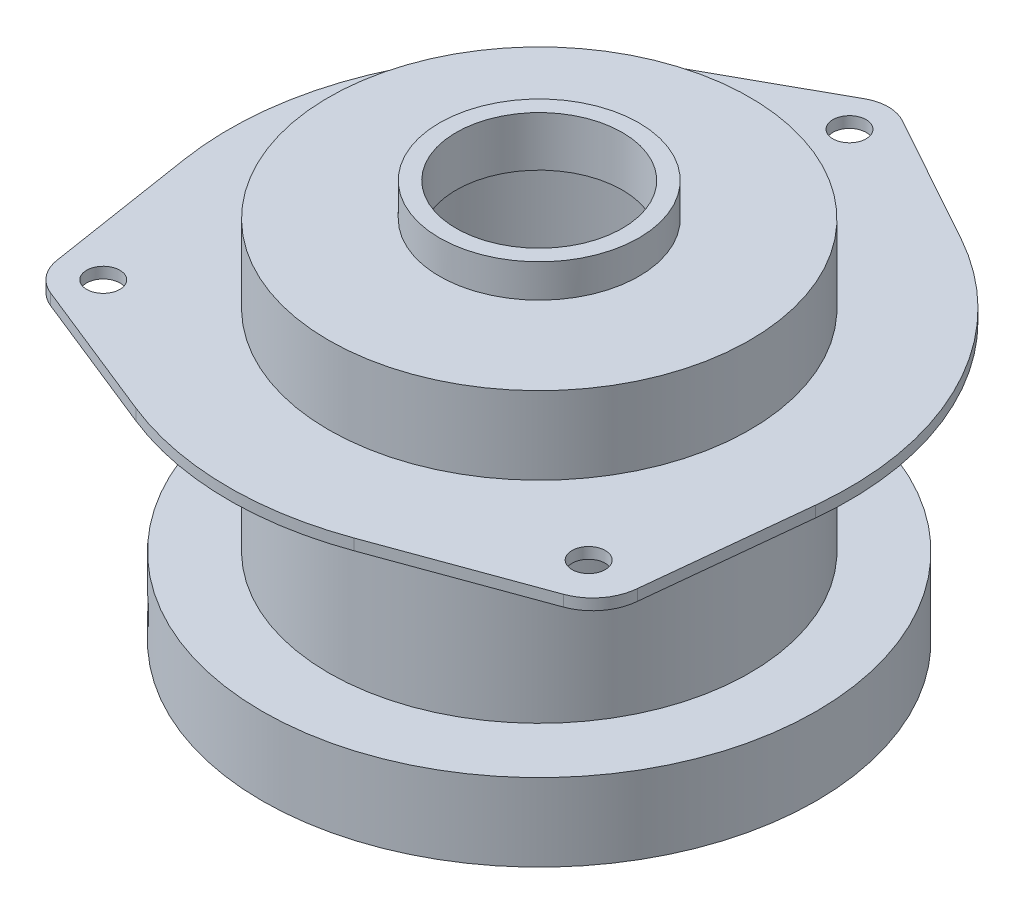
ISO-10303-21;
HEADER;
FILE_DESCRIPTION(('STEP AP214'),'2;1');
FILE_NAME('part.step','',(''),(''),'','','');
FILE_SCHEMA(('AUTOMOTIVE_DESIGN { 1 0 10303 214 1 1 1 1 }'));
ENDSEC;
DATA;
#1=APPLICATION_CONTEXT('core data for automotive mechanical design processes');
#2=APPLICATION_PROTOCOL_DEFINITION('international standard','automotive_design',2000,#1);
#3=PRODUCT_CONTEXT('',#1,'mechanical');
#4=PRODUCT('Part','Part','',(#3));
#5=PRODUCT_RELATED_PRODUCT_CATEGORY('part','',(#4));
#6=PRODUCT_DEFINITION_FORMATION('','',#4);
#7=PRODUCT_DEFINITION_CONTEXT('part definition',#1,'design');
#8=PRODUCT_DEFINITION('design','',#6,#7);
#9=PRODUCT_DEFINITION_SHAPE('','',#8);
#10=(LENGTH_UNIT() NAMED_UNIT(*) SI_UNIT(.MILLI.,.METRE.));
#11=(NAMED_UNIT(*) PLANE_ANGLE_UNIT() SI_UNIT($,.RADIAN.));
#12=(NAMED_UNIT(*) SI_UNIT($,.STERADIAN.) SOLID_ANGLE_UNIT());
#13=UNCERTAINTY_MEASURE_WITH_UNIT(LENGTH_MEASURE(1.E-05),#10,'distance_accuracy_value','');
#14=(GEOMETRIC_REPRESENTATION_CONTEXT(3) GLOBAL_UNCERTAINTY_ASSIGNED_CONTEXT((#13)) GLOBAL_UNIT_ASSIGNED_CONTEXT((#10,
#11,#12)) REPRESENTATION_CONTEXT('',''));
#15=CARTESIAN_POINT('',(0.,0.,0.));
#16=DIRECTION('',(0.,0.,1.));
#17=DIRECTION('',(1.,0.,0.));
#18=AXIS2_PLACEMENT_3D('',#15,#16,#17);
#19=CARTESIAN_POINT('',(0.,-26.,0.));
#20=DIRECTION('',(0.,1.,0.));
#21=DIRECTION('',(0.,0.,1.));
#22=AXIS2_PLACEMENT_3D('',#19,#20,#21);
#23=CYLINDRICAL_SURFACE('',#22,19.);
#24=CARTESIAN_POINT('',(0.,0.,0.));
#25=DIRECTION('',(0.,-1.,0.));
#26=DIRECTION('',(0.,0.,-1.));
#27=AXIS2_PLACEMENT_3D('',#24,#25,#26);
#28=CIRCLE('',#27,19.);
#29=CARTESIAN_POINT('',(0.,0.,19.));
#30=VERTEX_POINT('',#29);
#31=EDGE_CURVE('E301',#30,#30,#28,.T.);
#32=CARTESIAN_POINT('',(0.,-7.,0.));
#33=DIRECTION('',(0.,-1.,0.));
#34=DIRECTION('',(0.,0.,-1.));
#35=AXIS2_PLACEMENT_3D('',#32,#33,#34);
#36=CIRCLE('',#35,19.);
#37=CARTESIAN_POINT('',(0.,-7.,19.));
#38=VERTEX_POINT('',#37);
#39=EDGE_CURVE('E313',#38,#38,#36,.T.);
#40=CARTESIAN_POINT('',(0.,0.,19.));
#41=CARTESIAN_POINT('',(0.,-0.0729166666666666,19.));
#42=CARTESIAN_POINT('',(0.,-0.145833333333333,19.));
#43=CARTESIAN_POINT('',(0.,-0.291666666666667,19.));
#44=CARTESIAN_POINT('',(0.,-0.364583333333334,19.));
#45=CARTESIAN_POINT('',(0.,-0.510416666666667,19.));
#46=CARTESIAN_POINT('',(0.,-0.583333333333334,19.));
#47=CARTESIAN_POINT('',(0.,-0.729166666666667,19.));
#48=CARTESIAN_POINT('',(0.,-0.802083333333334,19.));
#49=CARTESIAN_POINT('',(0.,-0.947916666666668,19.));
#50=CARTESIAN_POINT('',(0.,-1.02083333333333,19.));
#51=CARTESIAN_POINT('',(0.,-1.16666666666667,19.));
#52=CARTESIAN_POINT('',(0.,-1.23958333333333,19.));
#53=CARTESIAN_POINT('',(0.,-1.38541666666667,19.));
#54=CARTESIAN_POINT('',(0.,-1.45833333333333,19.));
#55=CARTESIAN_POINT('',(0.,-1.60416666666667,19.));
#56=CARTESIAN_POINT('',(0.,-1.67708333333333,19.));
#57=CARTESIAN_POINT('',(0.,-1.82291666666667,19.));
#58=CARTESIAN_POINT('',(0.,-1.89583333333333,19.));
#59=CARTESIAN_POINT('',(0.,-2.04166666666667,19.));
#60=CARTESIAN_POINT('',(0.,-2.11458333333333,19.));
#61=CARTESIAN_POINT('',(0.,-2.26041666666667,19.));
#62=CARTESIAN_POINT('',(0.,-2.33333333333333,19.));
#63=CARTESIAN_POINT('',(0.,-2.47916666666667,19.));
#64=CARTESIAN_POINT('',(0.,-2.55208333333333,19.));
#65=CARTESIAN_POINT('',(0.,-2.69791666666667,19.));
#66=CARTESIAN_POINT('',(0.,-2.77083333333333,19.));
#67=CARTESIAN_POINT('',(0.,-2.91666666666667,19.));
#68=CARTESIAN_POINT('',(0.,-2.98958333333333,19.));
#69=CARTESIAN_POINT('',(0.,-3.13541666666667,19.));
#70=CARTESIAN_POINT('',(0.,-3.20833333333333,19.));
#71=CARTESIAN_POINT('',(0.,-3.35416666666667,19.));
#72=CARTESIAN_POINT('',(0.,-3.42708333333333,19.));
#73=CARTESIAN_POINT('',(0.,-3.57291666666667,19.));
#74=CARTESIAN_POINT('',(0.,-3.64583333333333,19.));
#75=CARTESIAN_POINT('',(0.,-3.79166666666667,19.));
#76=CARTESIAN_POINT('',(0.,-3.86458333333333,19.));
#77=CARTESIAN_POINT('',(0.,-4.01041666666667,19.));
#78=CARTESIAN_POINT('',(0.,-4.08333333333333,19.));
#79=CARTESIAN_POINT('',(0.,-4.22916666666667,19.));
#80=CARTESIAN_POINT('',(0.,-4.30208333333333,19.));
#81=CARTESIAN_POINT('',(0.,-4.44791666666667,19.));
#82=CARTESIAN_POINT('',(0.,-4.52083333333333,19.));
#83=CARTESIAN_POINT('',(0.,-4.66666666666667,19.));
#84=CARTESIAN_POINT('',(0.,-4.73958333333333,19.));
#85=CARTESIAN_POINT('',(0.,-4.88541666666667,19.));
#86=CARTESIAN_POINT('',(0.,-4.95833333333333,19.));
#87=CARTESIAN_POINT('',(0.,-5.10416666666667,19.));
#88=CARTESIAN_POINT('',(0.,-5.17708333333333,19.));
#89=CARTESIAN_POINT('',(0.,-5.32291666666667,19.));
#90=CARTESIAN_POINT('',(0.,-5.39583333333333,19.));
#91=CARTESIAN_POINT('',(0.,-5.54166666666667,19.));
#92=CARTESIAN_POINT('',(0.,-5.61458333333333,19.));
#93=CARTESIAN_POINT('',(0.,-5.76041666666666,19.));
#94=CARTESIAN_POINT('',(0.,-5.83333333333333,19.));
#95=CARTESIAN_POINT('',(0.,-5.97916666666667,19.));
#96=CARTESIAN_POINT('',(0.,-6.05208333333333,19.));
#97=CARTESIAN_POINT('',(0.,-6.19791666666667,19.));
#98=CARTESIAN_POINT('',(0.,-6.27083333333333,19.));
#99=CARTESIAN_POINT('',(0.,-6.41666666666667,19.));
#100=CARTESIAN_POINT('',(0.,-6.48958333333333,19.));
#101=CARTESIAN_POINT('',(0.,-6.63541666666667,19.));
#102=CARTESIAN_POINT('',(0.,-6.70833333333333,19.));
#103=CARTESIAN_POINT('',(0.,-6.85416666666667,19.));
#104=CARTESIAN_POINT('',(0.,-6.92708333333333,19.));
#105=CARTESIAN_POINT('',(0.,-7.,19.));
#106=B_SPLINE_CURVE_WITH_KNOTS('',3,(#40,#41,#42,#43,#44,#45,#46,#47,#48,#49,#50,#51,#52,#53,
#54,#55,#56,#57,#58,#59,#60,#61,#62,#63,#64,#65,#66,#67,#68,#69,#70,#71,#72,#73,#74,#75,#76,#77,
#78,#79,#80,#81,#82,#83,#84,#85,#86,#87,#88,#89,#90,#91,#92,#93,#94,#95,#96,#97,#98,#99,#100,
#101,#102,#103,#104,#105),.UNSPECIFIED.,.F.,.F.,(4,2,2,2,2,2,2,2,2,2,2,2,2,2,2,2,2,2,2,2,2,2,2,
2,2,2,2,2,2,2,2,2,4),(0.,0.21875,0.4375,0.656250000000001,0.875000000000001,1.09375,1.3125,
1.53125,1.75,1.96875,2.1875,2.40625,2.625,2.84375,3.0625,3.28125,3.5,3.71875,3.9375,4.15625,
4.375,4.59375,4.8125,5.03125,5.25,5.46875,5.6875,5.90625,6.125,6.34375,6.5625,6.78125,7.),.UNSPECIFIED.);
#107=EDGE_CURVE('BSEAM27',#30,#38,#106,.T.);
#108=ORIENTED_EDGE('',*,*,#31,.T.);
#109=ORIENTED_EDGE('',*,*,#39,.F.);
#110=ORIENTED_EDGE('',*,*,#107,.T.);
#111=ORIENTED_EDGE('',*,*,#107,.F.);
#112=EDGE_LOOP('',(#108,#110,#109,#111));
#113=FACE_BOUND('',#112,.T.);
#114=ADVANCED_FACE('F27',(#113),#23,.T.);
#115=CARTESIAN_POINT('',(0.,3.,0.));
#116=DIRECTION('',(0.,-1.,0.));
#117=DIRECTION('',(0.,0.,-1.));
#118=AXIS2_PLACEMENT_3D('',#115,#116,#117);
#119=CYLINDRICAL_SURFACE('',#118,9.);
#120=CARTESIAN_POINT('',(0.,3.,0.));
#121=DIRECTION('',(0.,1.,0.));
#122=DIRECTION('',(0.,0.,1.));
#123=AXIS2_PLACEMENT_3D('',#120,#121,#122);
#124=CIRCLE('',#123,9.);
#125=CARTESIAN_POINT('',(0.,3.,9.));
#126=VERTEX_POINT('',#125);
#127=EDGE_CURVE('E310',#126,#126,#124,.T.);
#128=ORIENTED_EDGE('',*,*,#127,.F.);
#129=EDGE_LOOP('',(#128));
#130=FACE_BOUND('',#129,.T.);
#131=CARTESIAN_POINT('',(0.,0.,0.));
#132=DIRECTION('',(0.,-1.,0.));
#133=DIRECTION('',(0.,0.,-1.));
#134=AXIS2_PLACEMENT_3D('',#131,#132,#133);
#135=CIRCLE('',#134,9.);
#136=CARTESIAN_POINT('',(0.,0.,-9.));
#137=VERTEX_POINT('',#136);
#138=EDGE_CURVE('E307',#137,#137,#135,.T.);
#139=ORIENTED_EDGE('',*,*,#138,.F.);
#140=EDGE_LOOP('',(#139));
#141=FACE_BOUND('',#140,.T.);
#142=ADVANCED_FACE('F29',(#130,#141),#119,.T.);
#143=CARTESIAN_POINT('',(0.,3.,0.));
#144=DIRECTION('',(0.,1.,0.));
#145=DIRECTION('',(0.,0.,1.));
#146=AXIS2_PLACEMENT_3D('',#143,#144,#145);
#147=PLANE('',#146);
#148=CARTESIAN_POINT('',(0.,3.,0.));
#149=DIRECTION('',(0.,-1.,0.));
#150=DIRECTION('',(0.,0.,-1.));
#151=AXIS2_PLACEMENT_3D('',#148,#149,#150);
#152=CIRCLE('',#151,7.5);
#153=CARTESIAN_POINT('',(0.,3.,-7.5));
#154=VERTEX_POINT('',#153);
#155=EDGE_CURVE('E256',#154,#154,#152,.T.);
#156=ORIENTED_EDGE('',*,*,#155,.T.);
#157=EDGE_LOOP('',(#156));
#158=FACE_BOUND('',#157,.T.);
#159=ORIENTED_EDGE('',*,*,#127,.T.);
#160=EDGE_LOOP('',(#159));
#161=FACE_BOUND('',#160,.T.);
#162=ADVANCED_FACE('F351',(#158,#161),#147,.T.);
#163=CARTESIAN_POINT('',(0.,0.,0.));
#164=DIRECTION('',(0.,-1.,0.));
#165=DIRECTION('',(0.,0.,-1.));
#166=AXIS2_PLACEMENT_3D('',#163,#164,#165);
#167=PLANE('',#166);
#168=ORIENTED_EDGE('',*,*,#31,.F.);
#169=EDGE_LOOP('',(#168));
#170=FACE_BOUND('',#169,.T.);
#171=ORIENTED_EDGE('',*,*,#138,.T.);
#172=EDGE_LOOP('',(#171));
#173=FACE_BOUND('',#172,.T.);
#174=ADVANCED_FACE('F356',(#170,#173),#167,.F.);
#175=CARTESIAN_POINT('',(0.,-8.,0.));
#176=DIRECTION('',(0.,1.,0.));
#177=DIRECTION('',(0.,0.,1.));
#178=AXIS2_PLACEMENT_3D('',#175,#176,#177);
#179=CIRCLE('',#178,19.);
#180=CARTESIAN_POINT('',(0.,-8.,19.));
#181=VERTEX_POINT('',#180);
#182=EDGE_CURVE('E156',#181,#181,#179,.T.);
#183=CARTESIAN_POINT('',(0.,-26.,0.));
#184=DIRECTION('',(0.,-1.,0.));
#185=DIRECTION('',(0.,0.,-1.));
#186=AXIS2_PLACEMENT_3D('',#183,#184,#185);
#187=CIRCLE('',#186,19.);
#188=CARTESIAN_POINT('',(0.,-26.,19.));
#189=VERTEX_POINT('',#188);
#190=EDGE_CURVE('E304',#189,#189,#187,.T.);
#191=CARTESIAN_POINT('',(0.,-8.,19.));
#192=CARTESIAN_POINT('',(0.,-8.1875,19.));
#193=CARTESIAN_POINT('',(0.,-8.375,19.));
#194=CARTESIAN_POINT('',(0.,-8.75,19.));
#195=CARTESIAN_POINT('',(0.,-8.9375,19.));
#196=CARTESIAN_POINT('',(0.,-9.3125,19.));
#197=CARTESIAN_POINT('',(0.,-9.5,19.));
#198=CARTESIAN_POINT('',(0.,-9.875,19.));
#199=CARTESIAN_POINT('',(0.,-10.0625,19.));
#200=CARTESIAN_POINT('',(0.,-10.4375,19.));
#201=CARTESIAN_POINT('',(0.,-10.625,19.));
#202=CARTESIAN_POINT('',(0.,-11.,19.));
#203=CARTESIAN_POINT('',(0.,-11.1875,19.));
#204=CARTESIAN_POINT('',(0.,-11.5625,19.));
#205=CARTESIAN_POINT('',(0.,-11.75,19.));
#206=CARTESIAN_POINT('',(0.,-12.125,19.));
#207=CARTESIAN_POINT('',(0.,-12.3125,19.));
#208=CARTESIAN_POINT('',(0.,-12.6875,19.));
#209=CARTESIAN_POINT('',(0.,-12.875,19.));
#210=CARTESIAN_POINT('',(0.,-13.25,19.));
#211=CARTESIAN_POINT('',(0.,-13.4375,19.));
#212=CARTESIAN_POINT('',(0.,-13.8125,19.));
#213=CARTESIAN_POINT('',(0.,-14.,19.));
#214=CARTESIAN_POINT('',(0.,-14.375,19.));
#215=CARTESIAN_POINT('',(0.,-14.5625,19.));
#216=CARTESIAN_POINT('',(0.,-14.9375,19.));
#217=CARTESIAN_POINT('',(0.,-15.125,19.));
#218=CARTESIAN_POINT('',(0.,-15.5,19.));
#219=CARTESIAN_POINT('',(0.,-15.6875,19.));
#220=CARTESIAN_POINT('',(0.,-16.0625,19.));
#221=CARTESIAN_POINT('',(0.,-16.25,19.));
#222=CARTESIAN_POINT('',(0.,-16.625,19.));
#223=CARTESIAN_POINT('',(0.,-16.8125,19.));
#224=CARTESIAN_POINT('',(0.,-17.1875,19.));
#225=CARTESIAN_POINT('',(0.,-17.375,19.));
#226=CARTESIAN_POINT('',(0.,-17.75,19.));
#227=CARTESIAN_POINT('',(0.,-17.9375,19.));
#228=CARTESIAN_POINT('',(0.,-18.3125,19.));
#229=CARTESIAN_POINT('',(0.,-18.5,19.));
#230=CARTESIAN_POINT('',(0.,-18.875,19.));
#231=CARTESIAN_POINT('',(0.,-19.0625,19.));
#232=CARTESIAN_POINT('',(0.,-19.4375,19.));
#233=CARTESIAN_POINT('',(0.,-19.625,19.));
#234=CARTESIAN_POINT('',(0.,-20.,19.));
#235=CARTESIAN_POINT('',(0.,-20.1875,19.));
#236=CARTESIAN_POINT('',(0.,-20.5625,19.));
#237=CARTESIAN_POINT('',(0.,-20.75,19.));
#238=CARTESIAN_POINT('',(0.,-21.125,19.));
#239=CARTESIAN_POINT('',(0.,-21.3125,19.));
#240=CARTESIAN_POINT('',(0.,-21.6875,19.));
#241=CARTESIAN_POINT('',(0.,-21.875,19.));
#242=CARTESIAN_POINT('',(0.,-22.25,19.));
#243=CARTESIAN_POINT('',(0.,-22.4375,19.));
#244=CARTESIAN_POINT('',(0.,-22.8125,19.));
#245=CARTESIAN_POINT('',(0.,-23.,19.));
#246=CARTESIAN_POINT('',(0.,-23.375,19.));
#247=CARTESIAN_POINT('',(0.,-23.5625,19.));
#248=CARTESIAN_POINT('',(0.,-23.9375,19.));
#249=CARTESIAN_POINT('',(0.,-24.125,19.));
#250=CARTESIAN_POINT('',(0.,-24.5,19.));
#251=CARTESIAN_POINT('',(0.,-24.6875,19.));
#252=CARTESIAN_POINT('',(0.,-25.0625,19.));
#253=CARTESIAN_POINT('',(0.,-25.25,19.));
#254=CARTESIAN_POINT('',(0.,-25.625,19.));
#255=CARTESIAN_POINT('',(0.,-25.8125,19.));
#256=CARTESIAN_POINT('',(0.,-26.,19.));
#257=B_SPLINE_CURVE_WITH_KNOTS('',3,(#191,#192,#193,#194,#195,#196,#197,#198,#199,#200,#201,
#202,#203,#204,#205,#206,#207,#208,#209,#210,#211,#212,#213,#214,#215,#216,#217,#218,#219,#220,
#221,#222,#223,#224,#225,#226,#227,#228,#229,#230,#231,#232,#233,#234,#235,#236,#237,#238,#239,
#240,#241,#242,#243,#244,#245,#246,#247,#248,#249,#250,#251,#252,#253,#254,#255,#256),
.UNSPECIFIED.,.F.,.F.,(4,2,2,2,2,2,2,2,2,2,2,2,2,2,2,2,2,2,2,2,2,2,2,2,2,2,2,2,2,2,2,2,4),(0.,
0.5625,1.125,1.6875,2.25,2.8125,3.375,3.9375,4.5,5.0625,5.625,6.1875,6.75,7.3125,7.875,8.4375,
9.,9.5625,10.125,10.6875,11.25,11.8125,12.375,12.9375,13.5,14.0625,14.625,15.1875,15.75,16.3125,
16.875,17.4375,18.),.UNSPECIFIED.);
#258=EDGE_CURVE('BSEAM345',#181,#189,#257,.T.);
#259=ORIENTED_EDGE('',*,*,#182,.F.);
#260=ORIENTED_EDGE('',*,*,#190,.F.);
#261=ORIENTED_EDGE('',*,*,#258,.T.);
#262=ORIENTED_EDGE('',*,*,#258,.F.);
#263=EDGE_LOOP('',(#259,#261,#260,#262));
#264=FACE_BOUND('',#263,.T.);
#265=ADVANCED_FACE('F345',(#264),#23,.T.);
#266=CARTESIAN_POINT('',(0.,-26.,0.));
#267=DIRECTION('',(0.,-1.,0.));
#268=DIRECTION('',(0.,0.,-1.));
#269=AXIS2_PLACEMENT_3D('',#266,#267,#268);
#270=PLANE('',#269);
#271=CARTESIAN_POINT('',(0.,-26.,0.));
#272=DIRECTION('',(0.,-1.,0.));
#273=DIRECTION('',(0.,0.,-1.));
#274=AXIS2_PLACEMENT_3D('',#271,#272,#273);
#275=CIRCLE('',#274,25.);
#276=CARTESIAN_POINT('',(0.,-26.,-25.));
#277=VERTEX_POINT('',#276);
#278=EDGE_CURVE('E284',#277,#277,#275,.T.);
#279=ORIENTED_EDGE('',*,*,#278,.F.);
#280=EDGE_LOOP('',(#279));
#281=FACE_BOUND('',#280,.T.);
#282=ORIENTED_EDGE('',*,*,#190,.T.);
#283=EDGE_LOOP('',(#282));
#284=FACE_BOUND('',#283,.T.);
#285=ADVANCED_FACE('F355',(#281,#284),#270,.F.);
#286=CARTESIAN_POINT('',(0.,-33.,0.));
#287=DIRECTION('',(0.,1.,0.));
#288=DIRECTION('',(0.,0.,1.));
#289=AXIS2_PLACEMENT_3D('',#286,#287,#288);
#290=CYLINDRICAL_SURFACE('',#289,25.);
#291=CARTESIAN_POINT('',(0.,-29.1165253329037,0.));
#292=DIRECTION('',(0.,1.,0.));
#293=DIRECTION('',(0.,0.,1.));
#294=AXIS2_PLACEMENT_3D('',#291,#292,#293);
#295=CIRCLE('',#294,25.);
#296=CARTESIAN_POINT('',(-16.2480768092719,-29.1165253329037,-19.));
#297=VERTEX_POINT('',#296);
#298=CARTESIAN_POINT('',(-16.2480768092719,-29.1165253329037,19.));
#299=VERTEX_POINT('',#298);
#300=EDGE_CURVE('E155',#297,#299,#295,.T.);
#301=ORIENTED_EDGE('',*,*,#300,.T.);
#302=DIRECTION('',(0.,1.,0.));
#303=VECTOR('',#302,1.);
#304=CARTESIAN_POINT('',(-16.2480768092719,-33.,19.));
#305=LINE('',#304,#303);
#306=CARTESIAN_POINT('',(-16.2480768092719,-30.9628283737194,19.));
#307=VERTEX_POINT('',#306);
#308=EDGE_CURVE('E147',#299,#307,#305,.F.);
#309=ORIENTED_EDGE('',*,*,#308,.T.);
#310=CARTESIAN_POINT('',(0.,-30.9628283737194,0.));
#311=DIRECTION('',(0.,-1.,0.));
#312=DIRECTION('',(0.,0.,-1.));
#313=AXIS2_PLACEMENT_3D('',#310,#311,#312);
#314=CIRCLE('',#313,25.);
#315=CARTESIAN_POINT('',(-16.2480768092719,-30.9628283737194,-19.));
#316=VERTEX_POINT('',#315);
#317=EDGE_CURVE('E136',#307,#316,#314,.T.);
#318=ORIENTED_EDGE('',*,*,#317,.T.);
#319=DIRECTION('',(0.,1.,0.));
#320=VECTOR('',#319,1.);
#321=CARTESIAN_POINT('',(-16.2480768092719,-33.,-19.));
#322=LINE('',#321,#320);
#323=EDGE_CURVE('E141',#316,#297,#322,.T.);
#324=ORIENTED_EDGE('',*,*,#323,.T.);
#325=EDGE_LOOP('',(#301,#309,#318,#324));
#326=FACE_BOUND('',#325,.T.);
#327=CARTESIAN_POINT('',(0.,-33.,0.));
#328=DIRECTION('',(0.,-1.,0.));
#329=DIRECTION('',(0.,0.,-1.));
#330=AXIS2_PLACEMENT_3D('',#327,#328,#329);
#331=CIRCLE('',#330,25.);
#332=CARTESIAN_POINT('',(0.,-33.,-25.));
#333=VERTEX_POINT('',#332);
#334=EDGE_CURVE('E298',#333,#333,#331,.T.);
#335=ORIENTED_EDGE('',*,*,#334,.F.);
#336=EDGE_LOOP('',(#335));
#337=FACE_BOUND('',#336,.T.);
#338=ORIENTED_EDGE('',*,*,#278,.T.);
#339=EDGE_LOOP('',(#338));
#340=FACE_BOUND('',#339,.T.);
#341=ADVANCED_FACE('F153',(#326,#337,#340),#290,.T.);
#342=CARTESIAN_POINT('',(0.,-33.,0.));
#343=DIRECTION('',(0.,-1.,0.));
#344=DIRECTION('',(0.,0.,-1.));
#345=AXIS2_PLACEMENT_3D('',#342,#343,#344);
#346=PLANE('',#345);
#347=CARTESIAN_POINT('',(0.,-33.,0.));
#348=DIRECTION('',(0.,-1.,0.));
#349=DIRECTION('',(0.,0.,-1.));
#350=AXIS2_PLACEMENT_3D('',#347,#348,#349);
#351=CIRCLE('',#350,23.5);
#352=CARTESIAN_POINT('',(0.,-33.,-23.5));
#353=VERTEX_POINT('',#352);
#354=EDGE_CURVE('E289',#353,#353,#351,.T.);
#355=ORIENTED_EDGE('',*,*,#354,.F.);
#356=EDGE_LOOP('',(#355));
#357=FACE_BOUND('',#356,.T.);
#358=ORIENTED_EDGE('',*,*,#334,.T.);
#359=EDGE_LOOP('',(#358));
#360=FACE_BOUND('',#359,.T.);
#361=ADVANCED_FACE('F470',(#357,#360),#346,.T.);
#362=CARTESIAN_POINT('',(0.,3.,0.));
#363=DIRECTION('',(0.,-1.,0.));
#364=DIRECTION('',(0.,0.,-1.));
#365=AXIS2_PLACEMENT_3D('',#362,#363,#364);
#366=CYLINDRICAL_SURFACE('',#365,7.5);
#367=CARTESIAN_POINT('',(0.,-1.5,0.));
#368=DIRECTION('',(0.,-1.,0.));
#369=DIRECTION('',(0.,0.,-1.));
#370=AXIS2_PLACEMENT_3D('',#367,#368,#369);
#371=CIRCLE('',#370,7.5);
#372=CARTESIAN_POINT('',(0.,-1.5,-7.5));
#373=VERTEX_POINT('',#372);
#374=EDGE_CURVE('E281',#373,#373,#371,.T.);
#375=ORIENTED_EDGE('',*,*,#374,.T.);
#376=EDGE_LOOP('',(#375));
#377=FACE_BOUND('',#376,.T.);
#378=ORIENTED_EDGE('',*,*,#155,.F.);
#379=EDGE_LOOP('',(#378));
#380=FACE_BOUND('',#379,.T.);
#381=ADVANCED_FACE('F467',(#377,#380),#366,.F.);
#382=CARTESIAN_POINT('',(0.,-1.5,0.));
#383=DIRECTION('',(0.,-1.,0.));
#384=DIRECTION('',(0.,0.,-1.));
#385=AXIS2_PLACEMENT_3D('',#382,#383,#384);
#386=PLANE('',#385);
#387=CARTESIAN_POINT('',(0.,-1.5,0.));
#388=DIRECTION('',(0.,-1.,0.));
#389=DIRECTION('',(0.,0.,-1.));
#390=AXIS2_PLACEMENT_3D('',#387,#388,#389);
#391=CIRCLE('',#390,17.5);
#392=CARTESIAN_POINT('',(0.,-1.5,17.5));
#393=VERTEX_POINT('',#392);
#394=EDGE_CURVE('E286',#393,#393,#391,.T.);
#395=ORIENTED_EDGE('',*,*,#394,.T.);
#396=EDGE_LOOP('',(#395));
#397=FACE_BOUND('',#396,.T.);
#398=ORIENTED_EDGE('',*,*,#374,.F.);
#399=EDGE_LOOP('',(#398));
#400=FACE_BOUND('',#399,.T.);
#401=ADVANCED_FACE('F469',(#397,#400),#386,.T.);
#402=CARTESIAN_POINT('',(0.,-26.,0.));
#403=DIRECTION('',(0.,1.,0.));
#404=DIRECTION('',(0.,0.,1.));
#405=AXIS2_PLACEMENT_3D('',#402,#403,#404);
#406=CYLINDRICAL_SURFACE('',#405,17.5);
#407=CARTESIAN_POINT('',(0.,-27.5,0.));
#408=DIRECTION('',(0.,-1.,0.));
#409=DIRECTION('',(0.,0.,-1.));
#410=AXIS2_PLACEMENT_3D('',#407,#408,#409);
#411=CIRCLE('',#410,17.5);
#412=CARTESIAN_POINT('',(0.,-27.5,17.5));
#413=VERTEX_POINT('',#412);
#414=EDGE_CURVE('E285',#413,#413,#411,.T.);
#415=CARTESIAN_POINT('',(0.,-27.5,17.5));
#416=CARTESIAN_POINT('',(0.,-27.2291666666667,17.5));
#417=CARTESIAN_POINT('',(0.,-26.9583333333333,17.5));
#418=CARTESIAN_POINT('',(0.,-26.4166666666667,17.5));
#419=CARTESIAN_POINT('',(0.,-26.1458333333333,17.5));
#420=CARTESIAN_POINT('',(0.,-25.6041666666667,17.5));
#421=CARTESIAN_POINT('',(0.,-25.3333333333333,17.5));
#422=CARTESIAN_POINT('',(0.,-24.7916666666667,17.5));
#423=CARTESIAN_POINT('',(0.,-24.5208333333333,17.5));
#424=CARTESIAN_POINT('',(0.,-23.9791666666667,17.5));
#425=CARTESIAN_POINT('',(0.,-23.7083333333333,17.5));
#426=CARTESIAN_POINT('',(0.,-23.1666666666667,17.5));
#427=CARTESIAN_POINT('',(0.,-22.8958333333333,17.5));
#428=CARTESIAN_POINT('',(0.,-22.3541666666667,17.5));
#429=CARTESIAN_POINT('',(0.,-22.0833333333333,17.5));
#430=CARTESIAN_POINT('',(0.,-21.5416666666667,17.5));
#431=CARTESIAN_POINT('',(0.,-21.2708333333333,17.5));
#432=CARTESIAN_POINT('',(0.,-20.7291666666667,17.5));
#433=CARTESIAN_POINT('',(0.,-20.4583333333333,17.5));
#434=CARTESIAN_POINT('',(0.,-19.9166666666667,17.5));
#435=CARTESIAN_POINT('',(0.,-19.6458333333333,17.5));
#436=CARTESIAN_POINT('',(0.,-19.1041666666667,17.5));
#437=CARTESIAN_POINT('',(0.,-18.8333333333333,17.5));
#438=CARTESIAN_POINT('',(0.,-18.2916666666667,17.5));
#439=CARTESIAN_POINT('',(0.,-18.0208333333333,17.5));
#440=CARTESIAN_POINT('',(0.,-17.4791666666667,17.5));
#441=CARTESIAN_POINT('',(0.,-17.2083333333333,17.5));
#442=CARTESIAN_POINT('',(0.,-16.6666666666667,17.5));
#443=CARTESIAN_POINT('',(0.,-16.3958333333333,17.5));
#444=CARTESIAN_POINT('',(0.,-15.8541666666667,17.5));
#445=CARTESIAN_POINT('',(0.,-15.5833333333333,17.5));
#446=CARTESIAN_POINT('',(0.,-15.0416666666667,17.5));
#447=CARTESIAN_POINT('',(0.,-14.7708333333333,17.5));
#448=CARTESIAN_POINT('',(0.,-14.2291666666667,17.5));
#449=CARTESIAN_POINT('',(0.,-13.9583333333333,17.5));
#450=CARTESIAN_POINT('',(0.,-13.4166666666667,17.5));
#451=CARTESIAN_POINT('',(0.,-13.1458333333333,17.5));
#452=CARTESIAN_POINT('',(0.,-12.6041666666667,17.5));
#453=CARTESIAN_POINT('',(0.,-12.3333333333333,17.5));
#454=CARTESIAN_POINT('',(0.,-11.7916666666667,17.5));
#455=CARTESIAN_POINT('',(0.,-11.5208333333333,17.5));
#456=CARTESIAN_POINT('',(0.,-10.9791666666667,17.5));
#457=CARTESIAN_POINT('',(0.,-10.7083333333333,17.5));
#458=CARTESIAN_POINT('',(0.,-10.1666666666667,17.5));
#459=CARTESIAN_POINT('',(0.,-9.89583333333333,17.5));
#460=CARTESIAN_POINT('',(0.,-9.35416666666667,17.5));
#461=CARTESIAN_POINT('',(0.,-9.08333333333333,17.5));
#462=CARTESIAN_POINT('',(0.,-8.54166666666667,17.5));
#463=CARTESIAN_POINT('',(0.,-8.27083333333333,17.5));
#464=CARTESIAN_POINT('',(0.,-7.72916666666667,17.5));
#465=CARTESIAN_POINT('',(0.,-7.45833333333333,17.5));
#466=CARTESIAN_POINT('',(0.,-6.91666666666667,17.5));
#467=CARTESIAN_POINT('',(0.,-6.64583333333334,17.5));
#468=CARTESIAN_POINT('',(0.,-6.10416666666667,17.5));
#469=CARTESIAN_POINT('',(0.,-5.83333333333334,17.5));
#470=CARTESIAN_POINT('',(0.,-5.29166666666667,17.5));
#471=CARTESIAN_POINT('',(0.,-5.02083333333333,17.5));
#472=CARTESIAN_POINT('',(0.,-4.47916666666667,17.5));
#473=CARTESIAN_POINT('',(0.,-4.20833333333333,17.5));
#474=CARTESIAN_POINT('',(0.,-3.66666666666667,17.5));
#475=CARTESIAN_POINT('',(0.,-3.39583333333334,17.5));
#476=CARTESIAN_POINT('',(0.,-2.85416666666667,17.5));
#477=CARTESIAN_POINT('',(0.,-2.58333333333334,17.5));
#478=CARTESIAN_POINT('',(0.,-2.04166666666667,17.5));
#479=CARTESIAN_POINT('',(0.,-1.77083333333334,17.5));
#480=CARTESIAN_POINT('',(0.,-1.5,17.5));
#481=B_SPLINE_CURVE_WITH_KNOTS('',3,(#415,#416,#417,#418,#419,#420,#421,#422,#423,#424,#425,
#426,#427,#428,#429,#430,#431,#432,#433,#434,#435,#436,#437,#438,#439,#440,#441,#442,#443,#444,
#445,#446,#447,#448,#449,#450,#451,#452,#453,#454,#455,#456,#457,#458,#459,#460,#461,#462,#463,
#464,#465,#466,#467,#468,#469,#470,#471,#472,#473,#474,#475,#476,#477,#478,#479,#480),
.UNSPECIFIED.,.F.,.F.,(4,2,2,2,2,2,2,2,2,2,2,2,2,2,2,2,2,2,2,2,2,2,2,2,2,2,2,2,2,2,2,2,4),(0.,
0.812500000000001,1.625,2.4375,3.25,4.0625,4.875,5.6875,6.5,7.3125,8.125,8.9375,9.75,10.5625,
11.375,12.1875,13.,13.8125,14.625,15.4375,16.25,17.0625,17.875,18.6875,19.5,20.3125,21.125,
21.9375,22.75,23.5625,24.375,25.1875,26.),.UNSPECIFIED.);
#482=EDGE_CURVE('BSEAM474',#413,#393,#481,.T.);
#483=ORIENTED_EDGE('',*,*,#414,.T.);
#484=ORIENTED_EDGE('',*,*,#394,.F.);
#485=ORIENTED_EDGE('',*,*,#482,.T.);
#486=ORIENTED_EDGE('',*,*,#482,.F.);
#487=EDGE_LOOP('',(#483,#485,#484,#486));
#488=FACE_BOUND('',#487,.T.);
#489=ADVANCED_FACE('F474',(#488),#406,.F.);
#490=CARTESIAN_POINT('',(0.,-27.5,0.));
#491=DIRECTION('',(0.,-1.,0.));
#492=DIRECTION('',(0.,0.,-1.));
#493=AXIS2_PLACEMENT_3D('',#490,#491,#492);
#494=PLANE('',#493);
#495=CARTESIAN_POINT('',(0.,-27.5,0.));
#496=DIRECTION('',(0.,-1.,0.));
#497=DIRECTION('',(0.,0.,-1.));
#498=AXIS2_PLACEMENT_3D('',#495,#496,#497);
#499=CIRCLE('',#498,23.5);
#500=CARTESIAN_POINT('',(0.,-27.5,-23.5));
#501=VERTEX_POINT('',#500);
#502=EDGE_CURVE('E280',#501,#501,#499,.T.);
#503=ORIENTED_EDGE('',*,*,#502,.T.);
#504=EDGE_LOOP('',(#503));
#505=FACE_BOUND('',#504,.T.);
#506=ORIENTED_EDGE('',*,*,#414,.F.);
#507=EDGE_LOOP('',(#506));
#508=FACE_BOUND('',#507,.T.);
#509=ADVANCED_FACE('F478',(#505,#508),#494,.T.);
#510=CARTESIAN_POINT('',(0.,-33.,0.));
#511=DIRECTION('',(0.,1.,0.));
#512=DIRECTION('',(0.,0.,1.));
#513=AXIS2_PLACEMENT_3D('',#510,#511,#512);
#514=CYLINDRICAL_SURFACE('',#513,23.5);
#515=DIRECTION('',(0.,1.,0.));
#516=VECTOR('',#515,1.);
#517=CARTESIAN_POINT('',(-13.8293166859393,-33.,19.));
#518=LINE('',#517,#516);
#519=CARTESIAN_POINT('',(-13.8293166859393,-29.1165253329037,19.));
#520=VERTEX_POINT('',#519);
#521=CARTESIAN_POINT('',(-13.8293166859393,-30.9628283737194,19.));
#522=VERTEX_POINT('',#521);
#523=EDGE_CURVE('E11',#520,#522,#518,.F.);
#524=ORIENTED_EDGE('',*,*,#523,.F.);
#525=CARTESIAN_POINT('',(0.,-29.1165253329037,0.));
#526=DIRECTION('',(0.,1.,0.));
#527=DIRECTION('',(0.,0.,1.));
#528=AXIS2_PLACEMENT_3D('',#525,#526,#527);
#529=CIRCLE('',#528,23.5);
#530=CARTESIAN_POINT('',(-13.8293166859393,-29.1165253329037,-19.));
#531=VERTEX_POINT('',#530);
#532=EDGE_CURVE('E35',#531,#520,#529,.T.);
#533=ORIENTED_EDGE('',*,*,#532,.F.);
#534=DIRECTION('',(0.,1.,0.));
#535=VECTOR('',#534,1.);
#536=CARTESIAN_POINT('',(-13.8293166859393,-33.,-19.));
#537=LINE('',#536,#535);
#538=CARTESIAN_POINT('',(-13.8293166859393,-30.9628283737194,-19.));
#539=VERTEX_POINT('',#538);
#540=EDGE_CURVE('E318',#539,#531,#537,.T.);
#541=ORIENTED_EDGE('',*,*,#540,.F.);
#542=CARTESIAN_POINT('',(0.,-30.9628283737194,0.));
#543=DIRECTION('',(0.,-1.,0.));
#544=DIRECTION('',(0.,0.,-1.));
#545=AXIS2_PLACEMENT_3D('',#542,#543,#544);
#546=CIRCLE('',#545,23.5);
#547=EDGE_CURVE('E316',#522,#539,#546,.T.);
#548=ORIENTED_EDGE('',*,*,#547,.F.);
#549=EDGE_LOOP('',(#524,#533,#541,#548));
#550=FACE_BOUND('',#549,.T.);
#551=ORIENTED_EDGE('',*,*,#354,.T.);
#552=EDGE_LOOP('',(#551));
#553=FACE_BOUND('',#552,.T.);
#554=ORIENTED_EDGE('',*,*,#502,.F.);
#555=EDGE_LOOP('',(#554));
#556=FACE_BOUND('',#555,.T.);
#557=ADVANCED_FACE('F328',(#550,#553,#556),#514,.F.);
#558=CARTESIAN_POINT('',(-21.9038990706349,-8.,17.4418810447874));
#559=DIRECTION('',(0.,1.,0.));
#560=DIRECTION('',(0.,0.,1.));
#561=AXIS2_PLACEMENT_3D('',#558,#559,#560);
#562=CYLINDRICAL_SURFACE('',#561,3.65966615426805);
#563=CARTESIAN_POINT('',(-21.9038990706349,-7.,17.4418810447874));
#564=DIRECTION('',(0.,1.,0.));
#565=DIRECTION('',(0.,0.,-1.));
#566=AXIS2_PLACEMENT_3D('',#563,#564,#565);
#567=CIRCLE('',#566,3.65966615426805);
#568=CARTESIAN_POINT('',(-25.5194383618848,-7.,18.0084778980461));
#569=VERTEX_POINT('',#568);
#570=CARTESIAN_POINT('',(-23.265775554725,-7.,20.8387102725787));
#571=VERTEX_POINT('',#570);
#572=EDGE_CURVE('E181',#569,#571,#567,.T.);
#573=ORIENTED_EDGE('',*,*,#572,.F.);
#574=DIRECTION('',(0.,1.,0.));
#575=VECTOR('',#574,1.);
#576=CARTESIAN_POINT('',(-25.5194383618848,-8.,18.0084778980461));
#577=LINE('',#576,#575);
#578=CARTESIAN_POINT('',(-25.5194383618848,-8.,18.0084778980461));
#579=VERTEX_POINT('',#578);
#580=EDGE_CURVE('E254',#579,#569,#577,.T.);
#581=ORIENTED_EDGE('',*,*,#580,.F.);
#582=CARTESIAN_POINT('',(-21.9038990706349,-8.,17.4418810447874));
#583=DIRECTION('',(0.,1.,0.));
#584=DIRECTION('',(0.,0.,-1.));
#585=AXIS2_PLACEMENT_3D('',#582,#583,#584);
#586=CIRCLE('',#585,3.65966615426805);
#587=CARTESIAN_POINT('',(-23.265775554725,-8.,20.8387102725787));
#588=VERTEX_POINT('',#587);
#589=EDGE_CURVE('E217',#579,#588,#586,.T.);
#590=ORIENTED_EDGE('',*,*,#589,.T.);
#591=DIRECTION('',(0.,1.,0.));
#592=VECTOR('',#591,1.);
#593=CARTESIAN_POINT('',(-23.265775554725,-8.,20.8387102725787));
#594=LINE('',#593,#592);
#595=EDGE_CURVE('E253',#588,#571,#594,.T.);
#596=ORIENTED_EDGE('',*,*,#595,.T.);
#597=EDGE_LOOP('',(#573,#581,#590,#596));
#598=FACE_BOUND('',#597,.T.);
#599=ADVANCED_FACE('F429',(#598),#562,.T.);
#600=CARTESIAN_POINT('',(-25.5194383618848,-8.,18.0084778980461));
#601=DIRECTION('',(-0.987942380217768,0.,0.154822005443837));
#602=DIRECTION('',(0.154822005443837,0.,0.987942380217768));
#603=AXIS2_PLACEMENT_3D('',#600,#601,#602);
#604=PLANE('',#603);
#605=DIRECTION('',(0.154822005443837,0.,0.987942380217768));
#606=VECTOR('',#605,1.);
#607=CARTESIAN_POINT('',(-25.5194383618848,-7.,18.0084778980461));
#608=LINE('',#607,#606);
#609=CARTESIAN_POINT('',(-27.6477182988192,-7.,4.42760520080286));
#610=VERTEX_POINT('',#609);
#611=EDGE_CURVE('E214',#610,#569,#608,.T.);
#612=ORIENTED_EDGE('',*,*,#611,.F.);
#613=DIRECTION('',(0.,1.,0.));
#614=VECTOR('',#613,1.);
#615=CARTESIAN_POINT('',(-27.6477182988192,-8.,4.42760520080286));
#616=LINE('',#615,#614);
#617=CARTESIAN_POINT('',(-27.6477182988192,-8.,4.42760520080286));
#618=VERTEX_POINT('',#617);
#619=EDGE_CURVE('E257',#618,#610,#616,.T.);
#620=ORIENTED_EDGE('',*,*,#619,.F.);
#621=DIRECTION('',(0.154822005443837,0.,0.987942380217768));
#622=VECTOR('',#621,1.);
#623=CARTESIAN_POINT('',(-25.5194383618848,-8.,18.0084778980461));
#624=LINE('',#623,#622);
#625=EDGE_CURVE('E250',#618,#579,#624,.T.);
#626=ORIENTED_EDGE('',*,*,#625,.T.);
#627=ORIENTED_EDGE('',*,*,#580,.T.);
#628=EDGE_LOOP('',(#612,#620,#626,#627));
#629=FACE_BOUND('',#628,.T.);
#630=ADVANCED_FACE('F391',(#629),#604,.T.);
#631=CARTESIAN_POINT('',(-1.2471891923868E-07,-8.,-9.93126522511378E-08));
#632=DIRECTION('',(0.,1.,0.));
#633=DIRECTION('',(0.,0.,1.));
#634=AXIS2_PLACEMENT_3D('',#631,#632,#633);
#635=CYLINDRICAL_SURFACE('',#634,28.0000001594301);
#636=CARTESIAN_POINT('',(-1.2471891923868E-07,-7.,-9.93126522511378E-08));
#637=DIRECTION('',(0.,1.,0.));
#638=DIRECTION('',(0.,0.,1.));
#639=AXIS2_PLACEMENT_3D('',#636,#637,#638);
#640=CIRCLE('',#639,28.0000001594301);
#641=CARTESIAN_POINT('',(-13.5554419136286,-7.,-24.500000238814));
#642=VERTEX_POINT('',#641);
#643=EDGE_CURVE('E211',#642,#610,#640,.T.);
#644=ORIENTED_EDGE('',*,*,#643,.F.);
#645=DIRECTION('',(0.,1.,0.));
#646=VECTOR('',#645,1.);
#647=CARTESIAN_POINT('',(-13.5554419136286,-8.,-24.500000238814));
#648=LINE('',#647,#646);
#649=CARTESIAN_POINT('',(-13.5554419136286,-8.,-24.500000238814));
#650=VERTEX_POINT('',#649);
#651=EDGE_CURVE('E259',#650,#642,#648,.T.);
#652=ORIENTED_EDGE('',*,*,#651,.F.);
#653=CARTESIAN_POINT('',(-1.2471891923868E-07,-8.,-9.93126522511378E-08));
#654=DIRECTION('',(0.,1.,0.));
#655=DIRECTION('',(0.,0.,1.));
#656=AXIS2_PLACEMENT_3D('',#653,#654,#655);
#657=CIRCLE('',#656,28.0000001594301);
#658=EDGE_CURVE('E247',#650,#618,#657,.T.);
#659=ORIENTED_EDGE('',*,*,#658,.T.);
#660=ORIENTED_EDGE('',*,*,#619,.T.);
#661=EDGE_LOOP('',(#644,#652,#659,#660));
#662=FACE_BOUND('',#661,.T.);
#663=ADVANCED_FACE('F395',(#662),#635,.T.);
#664=CARTESIAN_POINT('',(-1.69443033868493,-8.,-31.0625002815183));
#665=DIRECTION('',(-0.484122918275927,0.,-0.875));
#666=DIRECTION('',(-0.875,0.,0.484122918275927));
#667=AXIS2_PLACEMENT_3D('',#664,#665,#666);
#668=PLANE('',#667);
#669=DIRECTION('',(-0.875,0.,0.484122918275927));
#670=VECTOR('',#669,1.);
#671=CARTESIAN_POINT('',(-1.69443033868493,-7.,-31.0625002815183));
#672=LINE('',#671,#670);
#673=CARTESIAN_POINT('',(-1.69443033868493,-7.,-31.0625002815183));
#674=VERTEX_POINT('',#673);
#675=EDGE_CURVE('E208',#674,#642,#672,.T.);
#676=ORIENTED_EDGE('',*,*,#675,.F.);
#677=DIRECTION('',(0.,1.,0.));
#678=VECTOR('',#677,1.);
#679=CARTESIAN_POINT('',(-1.69443033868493,-8.,-31.0625002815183));
#680=LINE('',#679,#678);
#681=CARTESIAN_POINT('',(-1.69443033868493,-8.,-31.0625002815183));
#682=VERTEX_POINT('',#681);
#683=EDGE_CURVE('E261',#682,#674,#680,.T.);
#684=ORIENTED_EDGE('',*,*,#683,.F.);
#685=DIRECTION('',(-0.875,0.,0.484122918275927));
#686=VECTOR('',#685,1.);
#687=CARTESIAN_POINT('',(-1.69443033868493,-8.,-31.0625002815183));
#688=LINE('',#687,#686);
#689=EDGE_CURVE('E244',#682,#650,#688,.T.);
#690=ORIENTED_EDGE('',*,*,#689,.T.);
#691=ORIENTED_EDGE('',*,*,#651,.T.);
#692=EDGE_LOOP('',(#676,#684,#690,#691));
#693=FACE_BOUND('',#692,.T.);
#694=ADVANCED_FACE('F400',(#693),#668,.T.);
#695=CARTESIAN_POINT('',(-1.24719154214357E-07,-8.,-28.0000002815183));
#696=DIRECTION('',(0.,1.,0.));
#697=DIRECTION('',(0.,0.,1.));
#698=AXIS2_PLACEMENT_3D('',#695,#696,#697);
#699=CYLINDRICAL_SURFACE('',#698,3.50000000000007);
#700=CARTESIAN_POINT('',(-1.24719154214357E-07,-7.,-28.0000002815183));
#701=DIRECTION('',(0.,1.,0.));
#702=DIRECTION('',(0.,0.,1.));
#703=AXIS2_PLACEMENT_3D('',#700,#701,#702);
#704=CIRCLE('',#703,3.50000000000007);
#705=CARTESIAN_POINT('',(1.69443008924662,-7.,-31.0625002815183));
#706=VERTEX_POINT('',#705);
#707=EDGE_CURVE('E205',#706,#674,#704,.T.);
#708=ORIENTED_EDGE('',*,*,#707,.F.);
#709=DIRECTION('',(0.,1.,0.));
#710=VECTOR('',#709,1.);
#711=CARTESIAN_POINT('',(1.69443008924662,-8.,-31.0625002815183));
#712=LINE('',#711,#710);
#713=CARTESIAN_POINT('',(1.69443008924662,-8.,-31.0625002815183));
#714=VERTEX_POINT('',#713);
#715=EDGE_CURVE('E263',#714,#706,#712,.T.);
#716=ORIENTED_EDGE('',*,*,#715,.F.);
#717=CARTESIAN_POINT('',(-1.24719154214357E-07,-8.,-28.0000002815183));
#718=DIRECTION('',(0.,1.,0.));
#719=DIRECTION('',(0.,0.,1.));
#720=AXIS2_PLACEMENT_3D('',#717,#718,#719);
#721=CIRCLE('',#720,3.50000000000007);
#722=EDGE_CURVE('E241',#714,#682,#721,.T.);
#723=ORIENTED_EDGE('',*,*,#722,.T.);
#724=ORIENTED_EDGE('',*,*,#683,.T.);
#725=EDGE_LOOP('',(#708,#716,#723,#724));
#726=FACE_BOUND('',#725,.T.);
#727=ADVANCED_FACE('F403',(#726),#699,.T.);
#728=CARTESIAN_POINT('',(1.69443008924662,-8.,-31.0625002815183));
#729=DIRECTION('',(0.484122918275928,0.,-0.875));
#730=DIRECTION('',(-0.875,0.,-0.484122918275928));
#731=AXIS2_PLACEMENT_3D('',#728,#729,#730);
#732=PLANE('',#731);
#733=DIRECTION('',(-0.875,0.,-0.484122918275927));
#734=VECTOR('',#733,1.);
#735=CARTESIAN_POINT('',(1.69443008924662,-7.,-31.0625002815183));
#736=LINE('',#735,#734);
#737=CARTESIAN_POINT('',(13.5554416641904,-7.,-24.500000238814));
#738=VERTEX_POINT('',#737);
#739=EDGE_CURVE('E202',#738,#706,#736,.T.);
#740=ORIENTED_EDGE('',*,*,#739,.F.);
#741=DIRECTION('',(0.,1.,0.));
#742=VECTOR('',#741,1.);
#743=CARTESIAN_POINT('',(13.5554416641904,-8.,-24.500000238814));
#744=LINE('',#743,#742);
#745=CARTESIAN_POINT('',(13.5554416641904,-8.,-24.500000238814));
#746=VERTEX_POINT('',#745);
#747=EDGE_CURVE('E265',#746,#738,#744,.T.);
#748=ORIENTED_EDGE('',*,*,#747,.F.);
#749=DIRECTION('',(-0.875,0.,-0.484122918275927));
#750=VECTOR('',#749,1.);
#751=CARTESIAN_POINT('',(1.69443008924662,-8.,-31.0625002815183));
#752=LINE('',#751,#750);
#753=EDGE_CURVE('E238',#746,#714,#752,.T.);
#754=ORIENTED_EDGE('',*,*,#753,.T.);
#755=ORIENTED_EDGE('',*,*,#715,.T.);
#756=EDGE_LOOP('',(#740,#748,#754,#755));
#757=FACE_BOUND('',#756,.T.);
#758=ADVANCED_FACE('F408',(#757),#732,.T.);
#759=CARTESIAN_POINT('',(-1.24719311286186E-07,-8.,-9.93126913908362E-08));
#760=DIRECTION('',(0.,1.,0.));
#761=DIRECTION('',(0.,0.,1.));
#762=AXIS2_PLACEMENT_3D('',#759,#760,#761);
#763=CYLINDRICAL_SURFACE('',#762,28.00000015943);
#764=CARTESIAN_POINT('',(-1.24719311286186E-07,-7.,-9.93126913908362E-08));
#765=DIRECTION('',(0.,1.,0.));
#766=DIRECTION('',(0.,0.,1.));
#767=AXIS2_PLACEMENT_3D('',#764,#765,#766);
#768=CIRCLE('',#767,28.00000015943);
#769=CARTESIAN_POINT('',(27.8488065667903,-7.,2.90585171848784));
#770=VERTEX_POINT('',#769);
#771=EDGE_CURVE('E199',#770,#738,#768,.T.);
#772=ORIENTED_EDGE('',*,*,#771,.F.);
#773=DIRECTION('',(0.,1.,0.));
#774=VECTOR('',#773,1.);
#775=CARTESIAN_POINT('',(27.8488065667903,-8.,2.90585171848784));
#776=LINE('',#775,#774);
#777=CARTESIAN_POINT('',(27.8488065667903,-8.,2.90585171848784));
#778=VERTEX_POINT('',#777);
#779=EDGE_CURVE('E267',#778,#770,#776,.T.);
#780=ORIENTED_EDGE('',*,*,#779,.F.);
#781=CARTESIAN_POINT('',(-1.24719311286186E-07,-8.,-9.93126913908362E-08));
#782=DIRECTION('',(0.,1.,0.));
#783=DIRECTION('',(0.,0.,1.));
#784=AXIS2_PLACEMENT_3D('',#781,#782,#783);
#785=CIRCLE('',#784,28.00000015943);
#786=EDGE_CURVE('E235',#778,#746,#785,.T.);
#787=ORIENTED_EDGE('',*,*,#786,.T.);
#788=ORIENTED_EDGE('',*,*,#747,.T.);
#789=EDGE_LOOP('',(#772,#780,#787,#788));
#790=FACE_BOUND('',#789,.T.);
#791=ADVANCED_FACE('F411',(#790),#763,.T.);
#792=CARTESIAN_POINT('',(26.332061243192,-8.,17.4418810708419));
#793=DIRECTION('',(0.9946002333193,0.,0.103780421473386));
#794=DIRECTION('',(0.103780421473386,0.,-0.9946002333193));
#795=AXIS2_PLACEMENT_3D('',#792,#793,#794);
#796=PLANE('',#795);
#797=DIRECTION('',(0.103780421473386,0.,-0.9946002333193));
#798=VECTOR('',#797,1.);
#799=CARTESIAN_POINT('',(26.332061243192,-7.,17.4418810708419));
#800=LINE('',#799,#798);
#801=CARTESIAN_POINT('',(26.332061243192,-7.,17.4418810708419));
#802=VERTEX_POINT('',#801);
#803=EDGE_CURVE('E196',#802,#770,#800,.T.);
#804=ORIENTED_EDGE('',*,*,#803,.F.);
#805=DIRECTION('',(0.,1.,0.));
#806=VECTOR('',#805,1.);
#807=CARTESIAN_POINT('',(26.332061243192,-8.,17.4418810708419));
#808=LINE('',#807,#806);
#809=CARTESIAN_POINT('',(26.332061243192,-8.,17.4418810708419));
#810=VERTEX_POINT('',#809);
#811=EDGE_CURVE('E269',#810,#802,#808,.T.);
#812=ORIENTED_EDGE('',*,*,#811,.F.);
#813=DIRECTION('',(0.103780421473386,0.,-0.9946002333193));
#814=VECTOR('',#813,1.);
#815=CARTESIAN_POINT('',(26.332061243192,-8.,17.4418810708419));
#816=LINE('',#815,#814);
#817=EDGE_CURVE('E232',#810,#778,#816,.T.);
#818=ORIENTED_EDGE('',*,*,#817,.T.);
#819=ORIENTED_EDGE('',*,*,#779,.T.);
#820=EDGE_LOOP('',(#804,#812,#818,#819));
#821=FACE_BOUND('',#820,.T.);
#822=ADVANCED_FACE('F416',(#821),#796,.T.);
#823=CARTESIAN_POINT('',(21.9174577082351,-8.,17.0956187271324));
#824=DIRECTION('',(0.,1.,0.));
#825=DIRECTION('',(0.,0.,1.));
#826=AXIS2_PLACEMENT_3D('',#823,#824,#825);
#827=CYLINDRICAL_SURFACE('',#826,4.42816237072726);
#828=CARTESIAN_POINT('',(21.9174577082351,-7.,17.0956187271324));
#829=DIRECTION('',(0.,1.,0.));
#830=DIRECTION('',(0.,0.,-1.));
#831=AXIS2_PLACEMENT_3D('',#828,#829,#830);
#832=CIRCLE('',#831,4.42816237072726);
#833=CARTESIAN_POINT('',(23.435083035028,-7.,21.2555989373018));
#834=VERTEX_POINT('',#833);
#835=EDGE_CURVE('E193',#834,#802,#832,.T.);
#836=ORIENTED_EDGE('',*,*,#835,.F.);
#837=DIRECTION('',(0.,1.,0.));
#838=VECTOR('',#837,1.);
#839=CARTESIAN_POINT('',(23.435083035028,-8.,21.2555989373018));
#840=LINE('',#839,#838);
#841=CARTESIAN_POINT('',(23.435083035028,-8.,21.2555989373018));
#842=VERTEX_POINT('',#841);
#843=EDGE_CURVE('E271',#842,#834,#840,.T.);
#844=ORIENTED_EDGE('',*,*,#843,.F.);
#845=CARTESIAN_POINT('',(21.9174577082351,-8.,17.0956187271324));
#846=DIRECTION('',(0.,1.,0.));
#847=DIRECTION('',(0.,0.,-1.));
#848=AXIS2_PLACEMENT_3D('',#845,#846,#847);
#849=CIRCLE('',#848,4.42816237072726);
#850=EDGE_CURVE('E229',#842,#810,#849,.T.);
#851=ORIENTED_EDGE('',*,*,#850,.T.);
#852=ORIENTED_EDGE('',*,*,#811,.T.);
#853=EDGE_LOOP('',(#836,#844,#851,#852));
#854=FACE_BOUND('',#853,.T.);
#855=ADVANCED_FACE('F419',(#854),#827,.T.);
#856=CARTESIAN_POINT('',(23.435083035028,-8.,21.2555989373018));
#857=DIRECTION('',(0.3427212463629,0.,0.939437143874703));
#858=DIRECTION('',(0.939437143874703,0.,-0.3427212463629));
#859=AXIS2_PLACEMENT_3D('',#856,#857,#858);
#860=PLANE('',#859);
#861=DIRECTION('',(0.939437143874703,0.,-0.3427212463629));
#862=VECTOR('',#861,1.);
#863=CARTESIAN_POINT('',(23.435083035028,-7.,21.2555989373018));
#864=LINE('',#863,#862);
#865=CARTESIAN_POINT('',(9.59619482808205,-7.,26.3042400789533));
#866=VERTEX_POINT('',#865);
#867=EDGE_CURVE('E190',#866,#834,#864,.T.);
#868=ORIENTED_EDGE('',*,*,#867,.F.);
#869=DIRECTION('',(0.,1.,0.));
#870=VECTOR('',#869,1.);
#871=CARTESIAN_POINT('',(9.59619482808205,-8.,26.3042400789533));
#872=LINE('',#871,#870);
#873=CARTESIAN_POINT('',(9.59619482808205,-8.,26.3042400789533));
#874=VERTEX_POINT('',#873);
#875=EDGE_CURVE('E273',#874,#866,#872,.T.);
#876=ORIENTED_EDGE('',*,*,#875,.F.);
#877=DIRECTION('',(0.939437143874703,0.,-0.3427212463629));
#878=VECTOR('',#877,1.);
#879=CARTESIAN_POINT('',(23.435083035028,-8.,21.2555989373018));
#880=LINE('',#879,#878);
#881=EDGE_CURVE('E226',#874,#842,#880,.T.);
#882=ORIENTED_EDGE('',*,*,#881,.T.);
#883=ORIENTED_EDGE('',*,*,#843,.T.);
#884=EDGE_LOOP('',(#868,#876,#882,#883));
#885=FACE_BOUND('',#884,.T.);
#886=ADVANCED_FACE('F423',(#885),#860,.T.);
#887=CARTESIAN_POINT('',(-1.24719162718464E-07,-8.,-9.93127399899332E-08));
#888=DIRECTION('',(0.,1.,0.));
#889=DIRECTION('',(0.,0.,1.));
#890=AXIS2_PLACEMENT_3D('',#887,#888,#889);
#891=CYLINDRICAL_SURFACE('',#890,28.0000001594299);
#892=CARTESIAN_POINT('',(-1.24719162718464E-07,-7.,-9.93127399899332E-08));
#893=DIRECTION('',(0.,1.,0.));
#894=DIRECTION('',(0.,0.,-1.));
#895=AXIS2_PLACEMENT_3D('',#892,#893,#894);
#896=CIRCLE('',#895,28.0000001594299);
#897=CARTESIAN_POINT('',(-10.4196778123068,-7.,25.9890423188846));
#898=VERTEX_POINT('',#897);
#899=EDGE_CURVE('E187',#898,#866,#896,.T.);
#900=ORIENTED_EDGE('',*,*,#899,.F.);
#901=DIRECTION('',(0.,1.,0.));
#902=VECTOR('',#901,1.);
#903=CARTESIAN_POINT('',(-10.4196778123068,-8.,25.9890423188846));
#904=LINE('',#903,#902);
#905=CARTESIAN_POINT('',(-10.4196778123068,-8.,25.9890423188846));
#906=VERTEX_POINT('',#905);
#907=EDGE_CURVE('E275',#906,#898,#904,.T.);
#908=ORIENTED_EDGE('',*,*,#907,.F.);
#909=CARTESIAN_POINT('',(-1.24719162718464E-07,-8.,-9.93127399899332E-08));
#910=DIRECTION('',(0.,1.,0.));
#911=DIRECTION('',(0.,0.,-1.));
#912=AXIS2_PLACEMENT_3D('',#909,#910,#911);
#913=CIRCLE('',#912,28.0000001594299);
#914=EDGE_CURVE('E223',#906,#874,#913,.T.);
#915=ORIENTED_EDGE('',*,*,#914,.T.);
#916=ORIENTED_EDGE('',*,*,#875,.T.);
#917=EDGE_LOOP('',(#900,#908,#915,#916));
#918=FACE_BOUND('',#917,.T.);
#919=ADVANCED_FACE('F426',(#918),#891,.T.);
#920=CARTESIAN_POINT('',(-10.4196778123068,-8.,25.9890423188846));
#921=DIRECTION('',(-0.372131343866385,0.,0.928180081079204));
#922=DIRECTION('',(0.928180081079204,0.,0.372131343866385));
#923=AXIS2_PLACEMENT_3D('',#920,#921,#922);
#924=PLANE('',#923);
#925=DIRECTION('',(0.928180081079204,0.,0.372131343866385));
#926=VECTOR('',#925,1.);
#927=CARTESIAN_POINT('',(-10.4196778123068,-7.,25.9890423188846));
#928=LINE('',#927,#926);
#929=EDGE_CURVE('E184',#571,#898,#928,.T.);
#930=ORIENTED_EDGE('',*,*,#929,.F.);
#931=ORIENTED_EDGE('',*,*,#595,.F.);
#932=DIRECTION('',(0.928180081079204,0.,0.372131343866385));
#933=VECTOR('',#932,1.);
#934=CARTESIAN_POINT('',(-10.4196778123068,-8.,25.9890423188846));
#935=LINE('',#934,#933);
#936=EDGE_CURVE('E220',#588,#906,#935,.T.);
#937=ORIENTED_EDGE('',*,*,#936,.T.);
#938=ORIENTED_EDGE('',*,*,#907,.T.);
#939=EDGE_LOOP('',(#930,#931,#937,#938));
#940=FACE_BOUND('',#939,.T.);
#941=ADVANCED_FACE('F375',(#940),#924,.T.);
#942=CARTESIAN_POINT('',(-21.9038990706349,-8.,17.4418810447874));
#943=DIRECTION('',(0.,-1.,0.));
#944=DIRECTION('',(0.,0.,-1.));
#945=AXIS2_PLACEMENT_3D('',#942,#943,#944);
#946=PLANE('',#945);
#947=ORIENTED_EDGE('',*,*,#182,.T.);
#948=EDGE_LOOP('',(#947));
#949=FACE_BOUND('',#948,.T.);
#950=CARTESIAN_POINT('',(-21.9038988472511,-8.,17.4418810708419));
#951=DIRECTION('',(0.,1.,0.));
#952=DIRECTION('',(0.,0.,-1.));
#953=AXIS2_PLACEMENT_3D('',#950,#951,#952);
#954=CIRCLE('',#953,1.5);
#955=CARTESIAN_POINT('',(-21.9038988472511,-8.,15.9418810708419));
#956=VERTEX_POINT('',#955);
#957=EDGE_CURVE('E166',#956,#956,#954,.T.);
#958=ORIENTED_EDGE('',*,*,#957,.T.);
#959=EDGE_LOOP('',(#958));
#960=FACE_BOUND('',#959,.T.);
#961=CARTESIAN_POINT('',(21.9038988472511,-8.,17.4418810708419));
#962=DIRECTION('',(0.,1.,0.));
#963=DIRECTION('',(0.,0.,1.));
#964=AXIS2_PLACEMENT_3D('',#961,#962,#963);
#965=CIRCLE('',#964,1.5);
#966=CARTESIAN_POINT('',(21.9038988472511,-8.,18.9418810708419));
#967=VERTEX_POINT('',#966);
#968=EDGE_CURVE('E172',#967,#967,#965,.T.);
#969=ORIENTED_EDGE('',*,*,#968,.T.);
#970=EDGE_LOOP('',(#969));
#971=FACE_BOUND('',#970,.T.);
#972=CARTESIAN_POINT('',(0.,-8.,-28.));
#973=DIRECTION('',(0.,1.,0.));
#974=DIRECTION('',(0.,0.,1.));
#975=AXIS2_PLACEMENT_3D('',#972,#973,#974);
#976=CIRCLE('',#975,1.5);
#977=CARTESIAN_POINT('',(0.,-8.,-26.5));
#978=VERTEX_POINT('',#977);
#979=EDGE_CURVE('E178',#978,#978,#976,.T.);
#980=ORIENTED_EDGE('',*,*,#979,.T.);
#981=EDGE_LOOP('',(#980));
#982=FACE_BOUND('',#981,.T.);
#983=ORIENTED_EDGE('',*,*,#589,.F.);
#984=ORIENTED_EDGE('',*,*,#625,.F.);
#985=ORIENTED_EDGE('',*,*,#658,.F.);
#986=ORIENTED_EDGE('',*,*,#689,.F.);
#987=ORIENTED_EDGE('',*,*,#722,.F.);
#988=ORIENTED_EDGE('',*,*,#753,.F.);
#989=ORIENTED_EDGE('',*,*,#786,.F.);
#990=ORIENTED_EDGE('',*,*,#817,.F.);
#991=ORIENTED_EDGE('',*,*,#850,.F.);
#992=ORIENTED_EDGE('',*,*,#881,.F.);
#993=ORIENTED_EDGE('',*,*,#914,.F.);
#994=ORIENTED_EDGE('',*,*,#936,.F.);
#995=EDGE_LOOP('',(#983,#984,#985,#986,#987,#988,#989,#990,#991,#992,#993,#994));
#996=FACE_BOUND('',#995,.T.);
#997=ADVANCED_FACE('F371',(#949,#960,#971,#982,#996),#946,.T.);
#998=CARTESIAN_POINT('',(-21.9038990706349,-7.,17.4418810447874));
#999=DIRECTION('',(0.,-1.,0.));
#1000=DIRECTION('',(0.,0.,-1.));
#1001=AXIS2_PLACEMENT_3D('',#998,#999,#1000);
#1002=PLANE('',#1001);
#1003=ORIENTED_EDGE('',*,*,#39,.T.);
#1004=EDGE_LOOP('',(#1003));
#1005=FACE_BOUND('',#1004,.T.);
#1006=CARTESIAN_POINT('',(-21.9038988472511,-7.,17.4418810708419));
#1007=DIRECTION('',(0.,1.,0.));
#1008=DIRECTION('',(0.,0.,-1.));
#1009=AXIS2_PLACEMENT_3D('',#1006,#1007,#1008);
#1010=CIRCLE('',#1009,1.5);
#1011=CARTESIAN_POINT('',(-21.9038988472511,-7.,15.9418810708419));
#1012=VERTEX_POINT('',#1011);
#1013=EDGE_CURVE('E159',#1012,#1012,#1010,.T.);
#1014=ORIENTED_EDGE('',*,*,#1013,.F.);
#1015=EDGE_LOOP('',(#1014));
#1016=FACE_BOUND('',#1015,.T.);
#1017=CARTESIAN_POINT('',(21.9038988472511,-7.,17.4418810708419));
#1018=DIRECTION('',(0.,1.,0.));
#1019=DIRECTION('',(0.,0.,1.));
#1020=AXIS2_PLACEMENT_3D('',#1017,#1018,#1019);
#1021=CIRCLE('',#1020,1.5);
#1022=CARTESIAN_POINT('',(21.9038988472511,-7.,18.9418810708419));
#1023=VERTEX_POINT('',#1022);
#1024=EDGE_CURVE('E169',#1023,#1023,#1021,.T.);
#1025=ORIENTED_EDGE('',*,*,#1024,.F.);
#1026=EDGE_LOOP('',(#1025));
#1027=FACE_BOUND('',#1026,.T.);
#1028=CARTESIAN_POINT('',(0.,-7.,-28.));
#1029=DIRECTION('',(0.,1.,0.));
#1030=DIRECTION('',(0.,0.,1.));
#1031=AXIS2_PLACEMENT_3D('',#1028,#1029,#1030);
#1032=CIRCLE('',#1031,1.5);
#1033=CARTESIAN_POINT('',(0.,-7.,-26.5));
#1034=VERTEX_POINT('',#1033);
#1035=EDGE_CURVE('E175',#1034,#1034,#1032,.T.);
#1036=ORIENTED_EDGE('',*,*,#1035,.F.);
#1037=EDGE_LOOP('',(#1036));
#1038=FACE_BOUND('',#1037,.T.);
#1039=ORIENTED_EDGE('',*,*,#572,.T.);
#1040=ORIENTED_EDGE('',*,*,#929,.T.);
#1041=ORIENTED_EDGE('',*,*,#899,.T.);
#1042=ORIENTED_EDGE('',*,*,#867,.T.);
#1043=ORIENTED_EDGE('',*,*,#835,.T.);
#1044=ORIENTED_EDGE('',*,*,#803,.T.);
#1045=ORIENTED_EDGE('',*,*,#771,.T.);
#1046=ORIENTED_EDGE('',*,*,#739,.T.);
#1047=ORIENTED_EDGE('',*,*,#707,.T.);
#1048=ORIENTED_EDGE('',*,*,#675,.T.);
#1049=ORIENTED_EDGE('',*,*,#643,.T.);
#1050=ORIENTED_EDGE('',*,*,#611,.T.);
#1051=EDGE_LOOP('',(#1039,#1040,#1041,#1042,#1043,#1044,#1045,#1046,#1047,#1048,#1049,#1050));
#1052=FACE_BOUND('',#1051,.T.);
#1053=ADVANCED_FACE('F374',(#1005,#1016,#1027,#1038,#1052),#1002,.F.);
#1054=CARTESIAN_POINT('',(0.,-8.,-28.));
#1055=DIRECTION('',(0.,1.,0.));
#1056=DIRECTION('',(0.,0.,1.));
#1057=AXIS2_PLACEMENT_3D('',#1054,#1055,#1056);
#1058=CYLINDRICAL_SURFACE('',#1057,1.5);
#1059=ORIENTED_EDGE('',*,*,#979,.F.);
#1060=EDGE_LOOP('',(#1059));
#1061=FACE_BOUND('',#1060,.T.);
#1062=ORIENTED_EDGE('',*,*,#1035,.T.);
#1063=EDGE_LOOP('',(#1062));
#1064=FACE_BOUND('',#1063,.T.);
#1065=ADVANCED_FACE('F432',(#1061,#1064),#1058,.F.);
#1066=CARTESIAN_POINT('',(21.9038988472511,-8.,17.4418810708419));
#1067=DIRECTION('',(0.,1.,0.));
#1068=DIRECTION('',(0.,0.,1.));
#1069=AXIS2_PLACEMENT_3D('',#1066,#1067,#1068);
#1070=CYLINDRICAL_SURFACE('',#1069,1.5);
#1071=ORIENTED_EDGE('',*,*,#968,.F.);
#1072=EDGE_LOOP('',(#1071));
#1073=FACE_BOUND('',#1072,.T.);
#1074=ORIENTED_EDGE('',*,*,#1024,.T.);
#1075=EDGE_LOOP('',(#1074));
#1076=FACE_BOUND('',#1075,.T.);
#1077=ADVANCED_FACE('F438',(#1073,#1076),#1070,.F.);
#1078=CARTESIAN_POINT('',(-21.9038988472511,-8.,17.4418810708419));
#1079=DIRECTION('',(0.,1.,0.));
#1080=DIRECTION('',(0.,0.,1.));
#1081=AXIS2_PLACEMENT_3D('',#1078,#1079,#1080);
#1082=CYLINDRICAL_SURFACE('',#1081,1.5);
#1083=ORIENTED_EDGE('',*,*,#957,.F.);
#1084=EDGE_LOOP('',(#1083));
#1085=FACE_BOUND('',#1084,.T.);
#1086=ORIENTED_EDGE('',*,*,#1013,.T.);
#1087=EDGE_LOOP('',(#1086));
#1088=FACE_BOUND('',#1087,.T.);
#1089=ADVANCED_FACE('F496',(#1085,#1088),#1082,.F.);
#1090=CARTESIAN_POINT('',(-28.000000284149,-29.1165253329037,19.));
#1091=DIRECTION('',(0.,0.,1.));
#1092=DIRECTION('',(1.,0.,0.));
#1093=AXIS2_PLACEMENT_3D('',#1090,#1091,#1092);
#1094=PLANE('',#1093);
#1095=DIRECTION('',(1.,0.,0.));
#1096=VECTOR('',#1095,1.);
#1097=CARTESIAN_POINT('',(-28.000000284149,-29.1165253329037,19.));
#1098=LINE('',#1097,#1096);
#1099=EDGE_CURVE('E142',#299,#520,#1098,.T.);
#1100=ORIENTED_EDGE('',*,*,#1099,.T.);
#1101=ORIENTED_EDGE('',*,*,#523,.T.);
#1102=DIRECTION('',(1.,0.,0.));
#1103=VECTOR('',#1102,1.);
#1104=CARTESIAN_POINT('',(-28.000000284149,-30.9628283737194,19.));
#1105=LINE('',#1104,#1103);
#1106=EDGE_CURVE('E47',#307,#522,#1105,.T.);
#1107=ORIENTED_EDGE('',*,*,#1106,.F.);
#1108=ORIENTED_EDGE('',*,*,#308,.F.);
#1109=EDGE_LOOP('',(#1100,#1101,#1107,#1108));
#1110=FACE_BOUND('',#1109,.T.);
#1111=ADVANCED_FACE('F146',(#1110),#1094,.F.);
#1112=CARTESIAN_POINT('',(-28.000000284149,-29.1165253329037,19.));
#1113=DIRECTION('',(0.,1.,0.));
#1114=DIRECTION('',(0.,0.,1.));
#1115=AXIS2_PLACEMENT_3D('',#1112,#1113,#1114);
#1116=PLANE('',#1115);
#1117=DIRECTION('',(1.,0.,0.));
#1118=VECTOR('',#1117,1.);
#1119=CARTESIAN_POINT('',(-28.000000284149,-29.1165253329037,-19.));
#1120=LINE('',#1119,#1118);
#1121=EDGE_CURVE('E324',#297,#531,#1120,.T.);
#1122=ORIENTED_EDGE('',*,*,#1121,.T.);
#1123=ORIENTED_EDGE('',*,*,#532,.T.);
#1124=ORIENTED_EDGE('',*,*,#1099,.F.);
#1125=ORIENTED_EDGE('',*,*,#300,.F.);
#1126=EDGE_LOOP('',(#1122,#1123,#1124,#1125));
#1127=FACE_BOUND('',#1126,.T.);
#1128=ADVANCED_FACE('F322',(#1127),#1116,.F.);
#1129=CARTESIAN_POINT('',(-28.000000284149,-29.1165253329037,-19.));
#1130=DIRECTION('',(0.,0.,-1.));
#1131=DIRECTION('',(-1.,0.,0.));
#1132=AXIS2_PLACEMENT_3D('',#1129,#1130,#1131);
#1133=PLANE('',#1132);
#1134=DIRECTION('',(1.,0.,0.));
#1135=VECTOR('',#1134,1.);
#1136=CARTESIAN_POINT('',(-28.000000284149,-30.9628283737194,-19.));
#1137=LINE('',#1136,#1135);
#1138=EDGE_CURVE('E42',#316,#539,#1137,.T.);
#1139=ORIENTED_EDGE('',*,*,#1138,.T.);
#1140=ORIENTED_EDGE('',*,*,#540,.T.);
#1141=ORIENTED_EDGE('',*,*,#1121,.F.);
#1142=ORIENTED_EDGE('',*,*,#323,.F.);
#1143=EDGE_LOOP('',(#1139,#1140,#1141,#1142));
#1144=FACE_BOUND('',#1143,.T.);
#1145=ADVANCED_FACE('F331',(#1144),#1133,.F.);
#1146=CARTESIAN_POINT('',(-28.000000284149,-30.9628283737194,19.));
#1147=DIRECTION('',(0.,-1.,0.));
#1148=DIRECTION('',(0.,0.,-1.));
#1149=AXIS2_PLACEMENT_3D('',#1146,#1147,#1148);
#1150=PLANE('',#1149);
#1151=ORIENTED_EDGE('',*,*,#1106,.T.);
#1152=ORIENTED_EDGE('',*,*,#547,.T.);
#1153=ORIENTED_EDGE('',*,*,#1138,.F.);
#1154=ORIENTED_EDGE('',*,*,#317,.F.);
#1155=EDGE_LOOP('',(#1151,#1152,#1153,#1154));
#1156=FACE_BOUND('',#1155,.T.);
#1157=ADVANCED_FACE('F137',(#1156),#1150,.F.);
#1158=CLOSED_SHELL('',(#114,#142,#162,#174,#265,#285,#341,#361,#381,#401,#489,#509,#557,#599,
#630,#663,#694,#727,#758,#791,#822,#855,#886,#919,#941,#997,#1053,#1065,#1077,#1089,#1111,#1128,
#1145,#1157));
#1159=MANIFOLD_SOLID_BREP('B2',#1158);
#1160=ADVANCED_BREP_SHAPE_REPRESENTATION('',(#18,#1159),#14);
#1161=SHAPE_DEFINITION_REPRESENTATION(#9,#1160);
ENDSEC;
END-ISO-10303-21;
